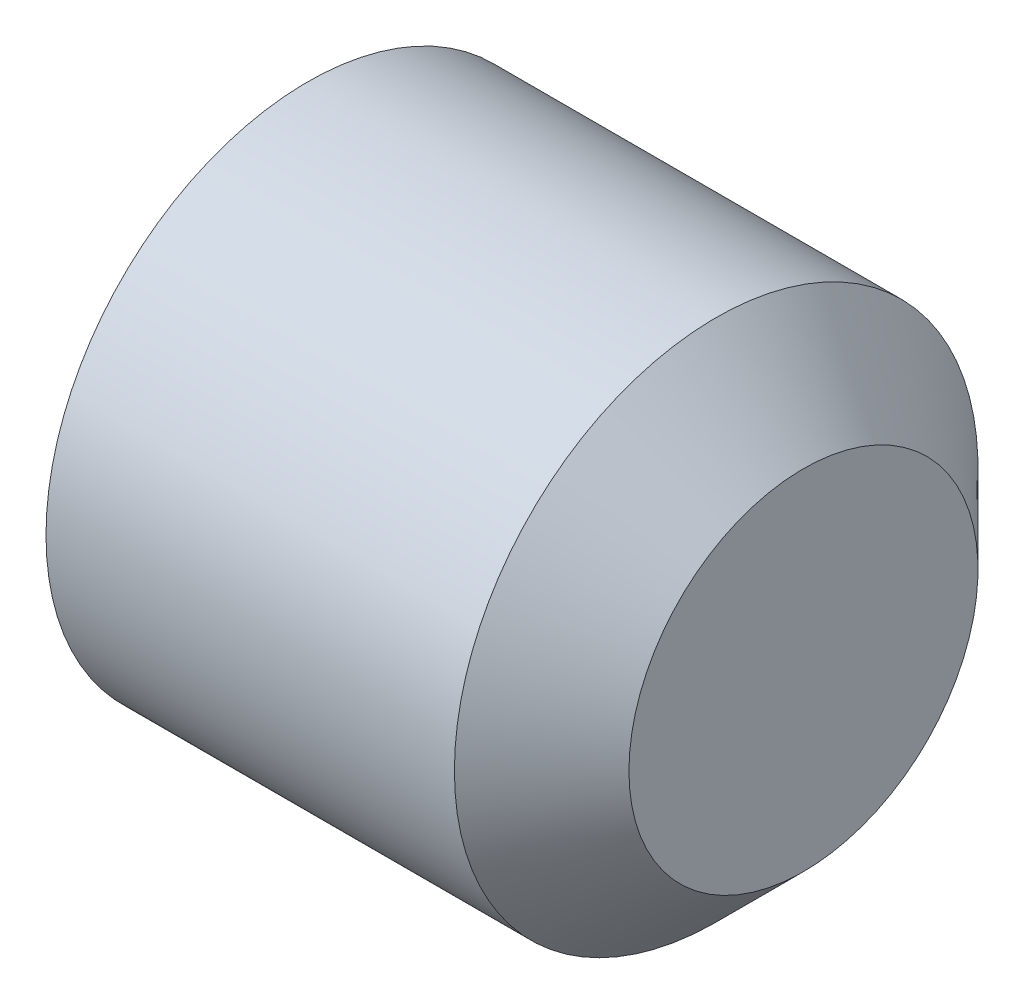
from build123d import *

# Parameters (mm, degrees)
HEX_2_DEPTH = 2


with BuildPart() as part:
    # BodySke → BaseBody (revolve)
    with BuildSketch(Plane.XY, mode=Mode.PRIVATE) as basebody_sk:
        Polygon((0, 0), (0, 2.4455), (0.320140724, 3), (5, 3), (6, 2), (6, 0), align=None)
    revolve(basebody_sk.sketch.rotate(Axis((-12.7, 0, 0), (1, 0, 0)), 90), axis=Axis((-12.7, 0, 0), (1, 0, 0)))

    # Sketch2 → Hex 2 (cut)
    with BuildSketch(Plane.ZY):
        Polygon((0.866025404, 1.5), (-0.866025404, 1.5), (-1.732050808, 0), (-0.866025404, -1.5), (0.866025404, -1.5), (1.732050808, 0), align=None)
    extrude(amount=-HEX_2_DEPTH, mode=Mode.SUBTRACT)


solid = part.part
